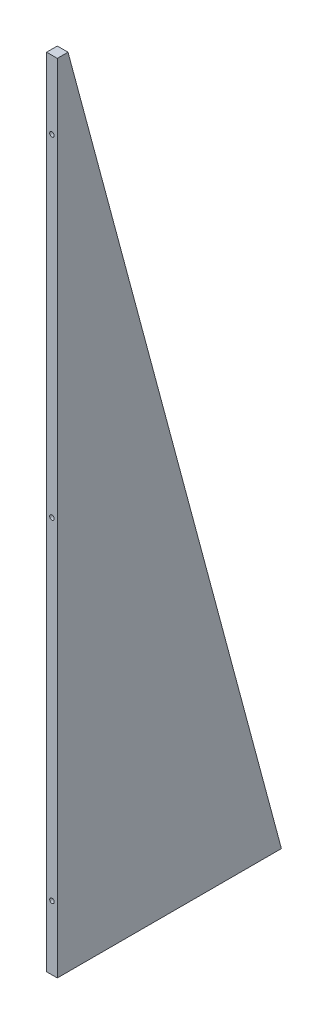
from build123d import *

# Parameters (mm, degrees)
BOSS_EXTRUDE1_DEPTH       = 6.35
F_6_32_TAPPED_HOLE1_D     = 2.7051
F_6_32_TAPPED_HOLE1_DEPTH = 10.9728
F_6_32_TAPPED_HOLE1_TIP   = 0.81269403
F_6_32_TAPPED_HOLE2_D     = 2.7051
F_6_32_TAPPED_HOLE2_DEPTH = 10.9728
F_6_32_TAPPED_HOLE2_TIP   = 0.81269403


with BuildPart() as part:
    # Sketch1 → Boss-Extrude1 (new body)
    with BuildSketch(Plane(origin=(0, 0, 0), x_dir=(0, 0, -1), z_dir=(1, 0, 0))):
        Polygon((0, 472.44), (0, 0), (132.939916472, 0), (6.35, 472.44), align=None)
    extrude(amount=BOSS_EXTRUDE1_DEPTH)

    # 6-32 Tapped Hole1
    with Locations(Plane(origin=(0, 0, 0), x_dir=(-1, 0, 0), z_dir=(0, -1, 0))):
        with Locations((-3.175, 25.4), (-3.175, 127)):
            Hole(F_6_32_TAPPED_HOLE1_D / 2, depth=F_6_32_TAPPED_HOLE1_DEPTH)
            with Locations((0, 0, -(F_6_32_TAPPED_HOLE1_DEPTH + F_6_32_TAPPED_HOLE1_TIP / 2))):  # 118° drill point
                Cone(0, F_6_32_TAPPED_HOLE1_D / 2, F_6_32_TAPPED_HOLE1_TIP, mode=Mode.SUBTRACT)

    # 6-32 Tapped Hole2
    with Locations(Plane.XY):
        with Locations((3.175, 38.1), (3.175, 234.95), (3.175, 431.8)):
            Hole(F_6_32_TAPPED_HOLE2_D / 2, depth=F_6_32_TAPPED_HOLE2_DEPTH)
            with Locations((0, 0, -(F_6_32_TAPPED_HOLE2_DEPTH + F_6_32_TAPPED_HOLE2_TIP / 2))):  # 118° drill point
                Cone(0, F_6_32_TAPPED_HOLE2_D / 2, F_6_32_TAPPED_HOLE2_TIP, mode=Mode.SUBTRACT)


solid = part.part
